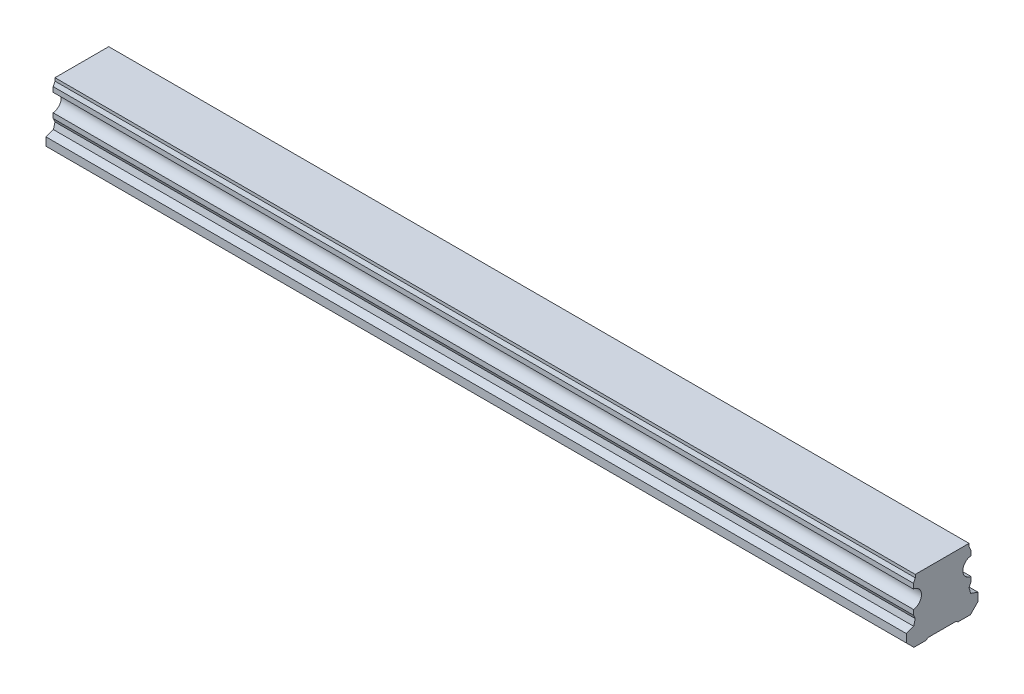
from build123d import *

# Parameters (mm, degrees)
BOSS_EXTRUDE1_DEPTH        = 300
SKETCH3_R                  = 3
SKETCH3_R_2                = 2.5
CUT_EXTRUDE3_DEPTH         = 12
SKETCH3_2_R                = 2.5
CUT_EXTRUDE4_DEPTH         = 15
CHAMFER1_SIZE              = 0.5
LPATTERN4_COUNT            = 5
LPATTERN4_PITCH            = 60
CHAMFER1_OF_LPATTERN4_SIZE = 0.5


with BuildPart() as part:
    # Sketch1 → Boss-Extrude1 (new body)
    with BuildSketch(Plane(origin=(0, 0, 0), x_dir=(0, 0, -1), z_dir=(1, 0, 0))):
        with BuildLine():
            Line((9.375, 21.8), (-9.375, 21.8))
            Line((-9.375, 21.8), (-9.375, 20.756))
            Line((-9.375, 20.756), (-10, 19.415683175))
            Line((-10, 19.415683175), (-10, 17.685449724))
            ThreePointArc((-10, 17.685449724), (-7.2, 14.6), (-10, 11.514550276))
            Line((-10, 11.514550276), (-10, 9.784316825))
            Line((-10, 9.784316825), (-9.375, 8.444))
            Line((-9.375, 8.444), (-9.922688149, 6.4))
            Line((-9.922688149, 6.4), (-12.5, 5.489338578))
            Line((-12.5, 5.489338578), (-12.5, 2.65))
            Line((-12.5, 2.65), (-9.85, 0))
            Line((-9.85, 0), (-5.5, 0))
            Line((-5.5, 0), (-5, 0.5))
            Line((-5, 0.5), (5, 0.5))
            Line((5, 0.5), (5.5, 0))
            Line((5.5, 0), (9.85, 0))
            Line((9.85, 0), (12.5, 2.65))
            Line((12.5, 2.65), (12.5, 5.489338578))
            Line((12.5, 5.489338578), (9.922688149, 6.4))
            Line((9.922688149, 6.4), (9.375, 8.444))
            Line((9.375, 8.444), (10, 9.784316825))
            Line((10, 9.784316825), (10, 11.514550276))
            ThreePointArc((10, 11.514550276), (7.2, 14.6), (10, 17.685449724))
            Line((10, 17.685449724), (10, 19.415683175))
            Line((10, 19.415683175), (9.375, 20.756))
            Line((9.375, 20.756), (9.375, 21.8))
        make_face()
    extrude(amount=BOSS_EXTRUDE1_DEPTH)

    # Sketch3 → Cut-Extrude3 (cut)
    with BuildSketch(Plane.XZ):
        with Locations(Location((30, 0, 0), (0, 0, 270))):
            Circle(SKETCH3_R)
        with Locations(Location((30, 0, 0), (0, 0, 270))):
            Circle(SKETCH3_R_2, mode=Mode.SUBTRACT)
    cut_extrude3 = extrude(amount=-CUT_EXTRUDE3_DEPTH, mode=Mode.SUBTRACT)

    # Sketch3_2 → Cut-Extrude4 (cut)
    with BuildSketch(Plane.XZ):
        with Locations(Location((30, 0, 0), (0, 0, 270))):
            Circle(SKETCH3_2_R)
    cut_extrude4 = extrude(amount=-CUT_EXTRUDE4_DEPTH, mode=Mode.SUBTRACT)

    # Cut-Extrude5 cone 1 section (on through the dimple's axis) → Cut-Extrude5 (revolve, cut)
    with BuildSketch(Plane(origin=(30, 15, 0), x_dir=(0, 0, -1), z_dir=(1, 0, 0))):
        Polygon((0, 0), (2.5, 0), (0, 1.443375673), align=None)
    cut_extrude5 = revolve(axis=Axis((30, 15, 0), (0, 1, 0)), mode=Mode.SUBTRACT)

    # Chamfer1
    chamfer1_edges = [part.edges().sort_by_distance(p)[0] for p in [
        (30, 0.5, 3),
    ]]
    chamfer(chamfer1_edges, length=CHAMFER1_SIZE)

    # LPattern4: Cut-Extrude3, Cut-Extrude4, Cut-Extrude5 ×5
    with Locations(*[(i * LPATTERN4_PITCH, 0, 0) for i in range(1, LPATTERN4_COUNT)]):
        add(cut_extrude3, mode=Mode.SUBTRACT)
        add(cut_extrude4, mode=Mode.SUBTRACT)
        add(cut_extrude5, mode=Mode.SUBTRACT)

    # Chamfer1 of LPattern4
    chamfer1_of_lpattern4_edges = [part.edges().sort_by_distance(p)[0] for p in [
        (90, 0.5, 3),
        (150, 0.5, 3),
        (210, 0.5, 3),
        (270, 0.5, 3),
    ]]
    chamfer(chamfer1_of_lpattern4_edges, length=CHAMFER1_OF_LPATTERN4_SIZE)


solid = part.part
